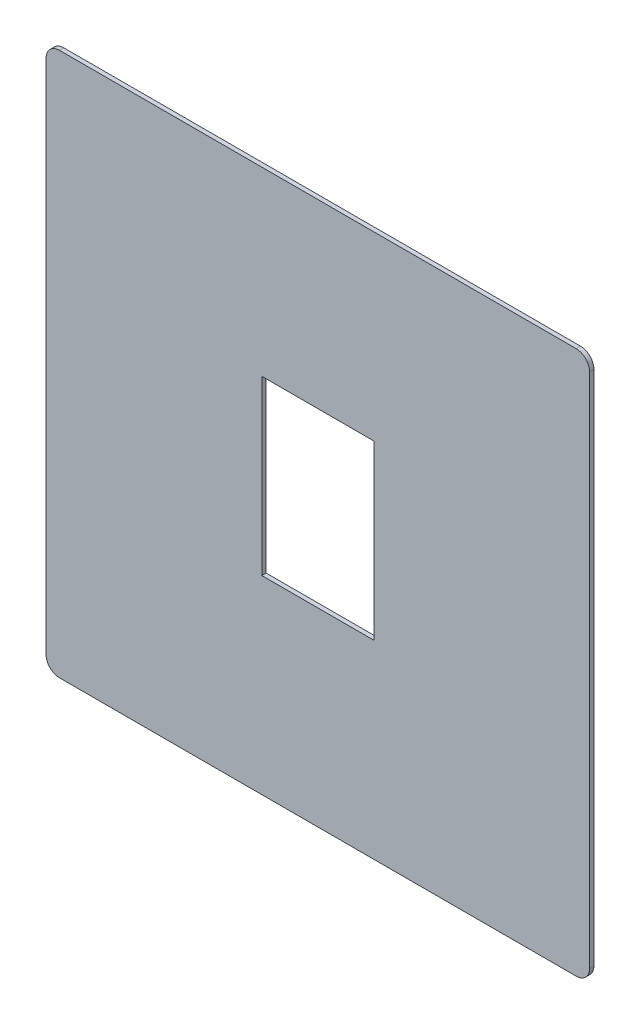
ISO-10303-21;
HEADER;
FILE_DESCRIPTION(('STEP AP214'),'2;1');
FILE_NAME('part.step','',(''),(''),'','','');
FILE_SCHEMA(('AUTOMOTIVE_DESIGN { 1 0 10303 214 1 1 1 1 }'));
ENDSEC;
DATA;
#1=APPLICATION_CONTEXT('core data for automotive mechanical design processes');
#2=APPLICATION_PROTOCOL_DEFINITION('international standard','automotive_design',2000,#1);
#3=PRODUCT_CONTEXT('',#1,'mechanical');
#4=PRODUCT('Part','Part','',(#3));
#5=PRODUCT_RELATED_PRODUCT_CATEGORY('part','',(#4));
#6=PRODUCT_DEFINITION_FORMATION('','',#4);
#7=PRODUCT_DEFINITION_CONTEXT('part definition',#1,'design');
#8=PRODUCT_DEFINITION('design','',#6,#7);
#9=PRODUCT_DEFINITION_SHAPE('','',#8);
#10=(LENGTH_UNIT() NAMED_UNIT(*) SI_UNIT(.MILLI.,.METRE.));
#11=(NAMED_UNIT(*) PLANE_ANGLE_UNIT() SI_UNIT($,.RADIAN.));
#12=(NAMED_UNIT(*) SI_UNIT($,.STERADIAN.) SOLID_ANGLE_UNIT());
#13=UNCERTAINTY_MEASURE_WITH_UNIT(LENGTH_MEASURE(1.E-05),#10,'distance_accuracy_value','');
#14=(GEOMETRIC_REPRESENTATION_CONTEXT(3) GLOBAL_UNCERTAINTY_ASSIGNED_CONTEXT((#13)) GLOBAL_UNIT_ASSIGNED_CONTEXT((#10,
#11,#12)) REPRESENTATION_CONTEXT('',''));
#15=CARTESIAN_POINT('',(0.,0.,0.));
#16=DIRECTION('',(0.,0.,1.));
#17=DIRECTION('',(1.,0.,0.));
#18=AXIS2_PLACEMENT_3D('',#15,#16,#17);
#19=CARTESIAN_POINT('',(29.9497474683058,29.4497474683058,0.5));
#20=DIRECTION('',(0.,0.,1.));
#21=DIRECTION('',(1.,0.,0.));
#22=AXIS2_PLACEMENT_3D('',#19,#20,#21);
#23=PLANE('',#22);
#24=CARTESIAN_POINT('',(29.9497474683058,29.4497474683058,0.5));
#25=DIRECTION('',(0.,0.,1.));
#26=DIRECTION('',(1.,0.,0.));
#27=AXIS2_PLACEMENT_3D('',#24,#25,#26);
#28=CIRCLE('',#27,1.55025253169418);
#29=CARTESIAN_POINT('',(31.5,29.4497474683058,0.5));
#30=VERTEX_POINT('',#29);
#31=CARTESIAN_POINT('',(29.9497474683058,31.,0.5));
#32=VERTEX_POINT('',#31);
#33=EDGE_CURVE('E172',#30,#32,#28,.T.);
#34=ORIENTED_EDGE('',*,*,#33,.T.);
#35=DIRECTION('',(-1.,0.,0.));
#36=VECTOR('',#35,1.);
#37=CARTESIAN_POINT('',(29.9497474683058,31.,0.5));
#38=LINE('',#37,#36);
#39=CARTESIAN_POINT('',(-29.9497474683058,31.,0.5));
#40=VERTEX_POINT('',#39);
#41=EDGE_CURVE('E175',#32,#40,#38,.T.);
#42=ORIENTED_EDGE('',*,*,#41,.T.);
#43=CARTESIAN_POINT('',(-29.9497474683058,29.4497474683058,0.5));
#44=DIRECTION('',(0.,0.,1.));
#45=DIRECTION('',(1.,0.,0.));
#46=AXIS2_PLACEMENT_3D('',#43,#44,#45);
#47=CIRCLE('',#46,1.55025253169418);
#48=CARTESIAN_POINT('',(-31.5,29.4497474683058,0.5));
#49=VERTEX_POINT('',#48);
#50=EDGE_CURVE('E177',#40,#49,#47,.T.);
#51=ORIENTED_EDGE('',*,*,#50,.T.);
#52=DIRECTION('',(0.,-1.,0.));
#53=VECTOR('',#52,1.);
#54=CARTESIAN_POINT('',(-31.5,29.4497474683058,0.5));
#55=LINE('',#54,#53);
#56=CARTESIAN_POINT('',(-31.5,-30.4497474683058,0.5));
#57=VERTEX_POINT('',#56);
#58=EDGE_CURVE('E179',#49,#57,#55,.T.);
#59=ORIENTED_EDGE('',*,*,#58,.T.);
#60=CARTESIAN_POINT('',(-29.9497474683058,-30.4497474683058,0.5));
#61=DIRECTION('',(0.,0.,1.));
#62=DIRECTION('',(1.,0.,0.));
#63=AXIS2_PLACEMENT_3D('',#60,#61,#62);
#64=CIRCLE('',#63,1.55025253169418);
#65=CARTESIAN_POINT('',(-29.9497474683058,-32.,0.5));
#66=VERTEX_POINT('',#65);
#67=EDGE_CURVE('E181',#57,#66,#64,.T.);
#68=ORIENTED_EDGE('',*,*,#67,.T.);
#69=DIRECTION('',(1.,0.,0.));
#70=VECTOR('',#69,1.);
#71=CARTESIAN_POINT('',(-29.9497474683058,-32.,0.5));
#72=LINE('',#71,#70);
#73=CARTESIAN_POINT('',(29.9497474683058,-32.,0.5));
#74=VERTEX_POINT('',#73);
#75=EDGE_CURVE('E183',#66,#74,#72,.T.);
#76=ORIENTED_EDGE('',*,*,#75,.T.);
#77=CARTESIAN_POINT('',(29.9497474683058,-30.4497474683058,0.5));
#78=DIRECTION('',(0.,0.,1.));
#79=DIRECTION('',(1.,0.,0.));
#80=AXIS2_PLACEMENT_3D('',#77,#78,#79);
#81=CIRCLE('',#80,1.55025253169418);
#82=CARTESIAN_POINT('',(31.5,-30.4497474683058,0.5));
#83=VERTEX_POINT('',#82);
#84=EDGE_CURVE('E185',#74,#83,#81,.T.);
#85=ORIENTED_EDGE('',*,*,#84,.T.);
#86=DIRECTION('',(0.,1.,0.));
#87=VECTOR('',#86,1.);
#88=CARTESIAN_POINT('',(31.5,-30.4497474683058,0.5));
#89=LINE('',#88,#87);
#90=EDGE_CURVE('E187',#83,#30,#89,.T.);
#91=ORIENTED_EDGE('',*,*,#90,.T.);
#92=EDGE_LOOP('',(#34,#42,#51,#59,#68,#76,#85,#91));
#93=FACE_BOUND('',#92,.T.);
#94=DIRECTION('',(0.,-1.,0.));
#95=VECTOR('',#94,1.);
#96=CARTESIAN_POINT('',(-6.5,10.,0.5));
#97=LINE('',#96,#95);
#98=CARTESIAN_POINT('',(-6.5,10.,0.5));
#99=VERTEX_POINT('',#98);
#100=CARTESIAN_POINT('',(-6.5,-9.99999999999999,0.5));
#101=VERTEX_POINT('',#100);
#102=EDGE_CURVE('E146',#99,#101,#97,.T.);
#103=ORIENTED_EDGE('',*,*,#102,.F.);
#104=DIRECTION('',(-1.,0.,0.));
#105=VECTOR('',#104,1.);
#106=CARTESIAN_POINT('',(6.5,10.,0.5));
#107=LINE('',#106,#105);
#108=CARTESIAN_POINT('',(6.5,10.,0.5));
#109=VERTEX_POINT('',#108);
#110=EDGE_CURVE('E135',#109,#99,#107,.T.);
#111=ORIENTED_EDGE('',*,*,#110,.F.);
#112=DIRECTION('',(0.,1.,0.));
#113=VECTOR('',#112,1.);
#114=CARTESIAN_POINT('',(6.5,-10.,0.5));
#115=LINE('',#114,#113);
#116=CARTESIAN_POINT('',(6.5,-9.99999999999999,0.5));
#117=VERTEX_POINT('',#116);
#118=EDGE_CURVE('E150',#117,#109,#115,.T.);
#119=ORIENTED_EDGE('',*,*,#118,.F.);
#120=DIRECTION('',(1.,0.,0.));
#121=VECTOR('',#120,1.);
#122=CARTESIAN_POINT('',(-6.5,-9.99999999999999,0.5));
#123=LINE('',#122,#121);
#124=EDGE_CURVE('E148',#101,#117,#123,.T.);
#125=ORIENTED_EDGE('',*,*,#124,.F.);
#126=EDGE_LOOP('',(#103,#111,#119,#125));
#127=FACE_BOUND('',#126,.T.);
#128=ADVANCED_FACE('F31',(#93,#127),#23,.T.);
#129=CARTESIAN_POINT('',(29.9497474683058,29.4497474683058,0.));
#130=DIRECTION('',(0.,0.,1.));
#131=DIRECTION('',(1.,0.,0.));
#132=AXIS2_PLACEMENT_3D('',#129,#130,#131);
#133=PLANE('',#132);
#134=CARTESIAN_POINT('',(29.9497474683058,29.4497474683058,0.));
#135=DIRECTION('',(0.,0.,1.));
#136=DIRECTION('',(1.,0.,0.));
#137=AXIS2_PLACEMENT_3D('',#134,#135,#136);
#138=CIRCLE('',#137,1.55025253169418);
#139=CARTESIAN_POINT('',(31.5,29.4497474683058,0.));
#140=VERTEX_POINT('',#139);
#141=CARTESIAN_POINT('',(29.9497474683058,31.,0.));
#142=VERTEX_POINT('',#141);
#143=EDGE_CURVE('E136',#140,#142,#138,.T.);
#144=ORIENTED_EDGE('',*,*,#143,.F.);
#145=DIRECTION('',(0.,1.,0.));
#146=VECTOR('',#145,1.);
#147=CARTESIAN_POINT('',(31.5,-30.4497474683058,0.));
#148=LINE('',#147,#146);
#149=CARTESIAN_POINT('',(31.5,-30.4497474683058,0.));
#150=VERTEX_POINT('',#149);
#151=EDGE_CURVE('E170',#150,#140,#148,.T.);
#152=ORIENTED_EDGE('',*,*,#151,.F.);
#153=CARTESIAN_POINT('',(29.9497474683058,-30.4497474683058,0.));
#154=DIRECTION('',(0.,0.,1.));
#155=DIRECTION('',(1.,0.,0.));
#156=AXIS2_PLACEMENT_3D('',#153,#154,#155);
#157=CIRCLE('',#156,1.55025253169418);
#158=CARTESIAN_POINT('',(29.9497474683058,-32.,0.));
#159=VERTEX_POINT('',#158);
#160=EDGE_CURVE('E168',#159,#150,#157,.T.);
#161=ORIENTED_EDGE('',*,*,#160,.F.);
#162=DIRECTION('',(1.,0.,0.));
#163=VECTOR('',#162,1.);
#164=CARTESIAN_POINT('',(-29.9497474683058,-32.,0.));
#165=LINE('',#164,#163);
#166=CARTESIAN_POINT('',(-29.9497474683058,-32.,0.));
#167=VERTEX_POINT('',#166);
#168=EDGE_CURVE('E166',#167,#159,#165,.T.);
#169=ORIENTED_EDGE('',*,*,#168,.F.);
#170=CARTESIAN_POINT('',(-29.9497474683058,-30.4497474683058,0.));
#171=DIRECTION('',(0.,0.,1.));
#172=DIRECTION('',(1.,0.,0.));
#173=AXIS2_PLACEMENT_3D('',#170,#171,#172);
#174=CIRCLE('',#173,1.55025253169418);
#175=CARTESIAN_POINT('',(-31.5,-30.4497474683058,0.));
#176=VERTEX_POINT('',#175);
#177=EDGE_CURVE('E164',#176,#167,#174,.T.);
#178=ORIENTED_EDGE('',*,*,#177,.F.);
#179=DIRECTION('',(0.,-1.,0.));
#180=VECTOR('',#179,1.);
#181=CARTESIAN_POINT('',(-31.5,29.4497474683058,0.));
#182=LINE('',#181,#180);
#183=CARTESIAN_POINT('',(-31.5,29.4497474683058,0.));
#184=VERTEX_POINT('',#183);
#185=EDGE_CURVE('E162',#184,#176,#182,.T.);
#186=ORIENTED_EDGE('',*,*,#185,.F.);
#187=CARTESIAN_POINT('',(-29.9497474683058,29.4497474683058,0.));
#188=DIRECTION('',(0.,0.,1.));
#189=DIRECTION('',(1.,0.,0.));
#190=AXIS2_PLACEMENT_3D('',#187,#188,#189);
#191=CIRCLE('',#190,1.55025253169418);
#192=CARTESIAN_POINT('',(-29.9497474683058,31.,0.));
#193=VERTEX_POINT('',#192);
#194=EDGE_CURVE('E160',#193,#184,#191,.T.);
#195=ORIENTED_EDGE('',*,*,#194,.F.);
#196=DIRECTION('',(-1.,0.,0.));
#197=VECTOR('',#196,1.);
#198=CARTESIAN_POINT('',(29.9497474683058,31.,0.));
#199=LINE('',#198,#197);
#200=EDGE_CURVE('E158',#142,#193,#199,.T.);
#201=ORIENTED_EDGE('',*,*,#200,.F.);
#202=EDGE_LOOP('',(#144,#152,#161,#169,#178,#186,#195,#201));
#203=FACE_BOUND('',#202,.T.);
#204=DIRECTION('',(-1.,0.,0.));
#205=VECTOR('',#204,1.);
#206=CARTESIAN_POINT('',(6.5,10.,0.));
#207=LINE('',#206,#205);
#208=CARTESIAN_POINT('',(6.5,10.,0.));
#209=VERTEX_POINT('',#208);
#210=CARTESIAN_POINT('',(-6.5,10.,0.));
#211=VERTEX_POINT('',#210);
#212=EDGE_CURVE('E54',#209,#211,#207,.T.);
#213=ORIENTED_EDGE('',*,*,#212,.T.);
#214=DIRECTION('',(0.,-1.,0.));
#215=VECTOR('',#214,1.);
#216=CARTESIAN_POINT('',(-6.5,10.,0.));
#217=LINE('',#216,#215);
#218=CARTESIAN_POINT('',(-6.5,-9.99999999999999,0.));
#219=VERTEX_POINT('',#218);
#220=EDGE_CURVE('E122',#211,#219,#217,.T.);
#221=ORIENTED_EDGE('',*,*,#220,.T.);
#222=DIRECTION('',(1.,0.,0.));
#223=VECTOR('',#222,1.);
#224=CARTESIAN_POINT('',(-6.5,-9.99999999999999,0.));
#225=LINE('',#224,#223);
#226=CARTESIAN_POINT('',(6.5,-10.,0.));
#227=VERTEX_POINT('',#226);
#228=EDGE_CURVE('E131',#219,#227,#225,.T.);
#229=ORIENTED_EDGE('',*,*,#228,.T.);
#230=DIRECTION('',(0.,1.,0.));
#231=VECTOR('',#230,1.);
#232=CARTESIAN_POINT('',(6.5,-10.,0.));
#233=LINE('',#232,#231);
#234=EDGE_CURVE('E140',#227,#209,#233,.T.);
#235=ORIENTED_EDGE('',*,*,#234,.T.);
#236=EDGE_LOOP('',(#213,#221,#229,#235));
#237=FACE_BOUND('',#236,.T.);
#238=ADVANCED_FACE('F139',(#203,#237),#133,.F.);
#239=CARTESIAN_POINT('',(29.9497474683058,29.4497474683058,0.5));
#240=DIRECTION('',(0.,0.,-1.));
#241=DIRECTION('',(-1.,0.,0.));
#242=AXIS2_PLACEMENT_3D('',#239,#240,#241);
#243=CYLINDRICAL_SURFACE('',#242,1.55025253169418);
#244=ORIENTED_EDGE('',*,*,#143,.T.);
#245=DIRECTION('',(0.,0.,-1.));
#246=VECTOR('',#245,1.);
#247=CARTESIAN_POINT('',(29.9497474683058,31.,0.5));
#248=LINE('',#247,#246);
#249=EDGE_CURVE('E11',#32,#142,#248,.T.);
#250=ORIENTED_EDGE('',*,*,#249,.F.);
#251=ORIENTED_EDGE('',*,*,#33,.F.);
#252=DIRECTION('',(0.,0.,-1.));
#253=VECTOR('',#252,1.);
#254=CARTESIAN_POINT('',(31.5,29.4497474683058,0.5));
#255=LINE('',#254,#253);
#256=EDGE_CURVE('E189',#30,#140,#255,.T.);
#257=ORIENTED_EDGE('',*,*,#256,.T.);
#258=EDGE_LOOP('',(#244,#250,#251,#257));
#259=FACE_BOUND('',#258,.T.);
#260=ADVANCED_FACE('F33',(#259),#243,.T.);
#261=CARTESIAN_POINT('',(29.9497474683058,31.,0.5));
#262=DIRECTION('',(0.,-1.,0.));
#263=DIRECTION('',(0.,0.,-1.));
#264=AXIS2_PLACEMENT_3D('',#261,#262,#263);
#265=PLANE('',#264);
#266=ORIENTED_EDGE('',*,*,#200,.T.);
#267=DIRECTION('',(0.,0.,-1.));
#268=VECTOR('',#267,1.);
#269=CARTESIAN_POINT('',(-29.9497474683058,31.,0.5));
#270=LINE('',#269,#268);
#271=EDGE_CURVE('E39',#40,#193,#270,.T.);
#272=ORIENTED_EDGE('',*,*,#271,.F.);
#273=ORIENTED_EDGE('',*,*,#41,.F.);
#274=ORIENTED_EDGE('',*,*,#249,.T.);
#275=EDGE_LOOP('',(#266,#272,#273,#274));
#276=FACE_BOUND('',#275,.T.);
#277=ADVANCED_FACE('F233',(#276),#265,.F.);
#278=CARTESIAN_POINT('',(-29.9497474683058,29.4497474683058,0.5));
#279=DIRECTION('',(0.,0.,-1.));
#280=DIRECTION('',(-1.,0.,0.));
#281=AXIS2_PLACEMENT_3D('',#278,#279,#280);
#282=CYLINDRICAL_SURFACE('',#281,1.55025253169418);
#283=ORIENTED_EDGE('',*,*,#194,.T.);
#284=DIRECTION('',(0.,0.,-1.));
#285=VECTOR('',#284,1.);
#286=CARTESIAN_POINT('',(-31.5,29.4497474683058,0.5));
#287=LINE('',#286,#285);
#288=EDGE_CURVE('E204',#49,#184,#287,.T.);
#289=ORIENTED_EDGE('',*,*,#288,.F.);
#290=ORIENTED_EDGE('',*,*,#50,.F.);
#291=ORIENTED_EDGE('',*,*,#271,.T.);
#292=EDGE_LOOP('',(#283,#289,#290,#291));
#293=FACE_BOUND('',#292,.T.);
#294=ADVANCED_FACE('F211',(#293),#282,.T.);
#295=CARTESIAN_POINT('',(-31.5,29.4497474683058,0.5));
#296=DIRECTION('',(1.,0.,0.));
#297=DIRECTION('',(0.,1.,0.));
#298=AXIS2_PLACEMENT_3D('',#295,#296,#297);
#299=PLANE('',#298);
#300=ORIENTED_EDGE('',*,*,#185,.T.);
#301=DIRECTION('',(0.,0.,-1.));
#302=VECTOR('',#301,1.);
#303=CARTESIAN_POINT('',(-31.5,-30.4497474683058,0.5));
#304=LINE('',#303,#302);
#305=EDGE_CURVE('E201',#57,#176,#304,.T.);
#306=ORIENTED_EDGE('',*,*,#305,.F.);
#307=ORIENTED_EDGE('',*,*,#58,.F.);
#308=ORIENTED_EDGE('',*,*,#288,.T.);
#309=EDGE_LOOP('',(#300,#306,#307,#308));
#310=FACE_BOUND('',#309,.T.);
#311=ADVANCED_FACE('F221',(#310),#299,.F.);
#312=CARTESIAN_POINT('',(-29.9497474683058,-30.4497474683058,0.5));
#313=DIRECTION('',(0.,0.,-1.));
#314=DIRECTION('',(-1.,0.,0.));
#315=AXIS2_PLACEMENT_3D('',#312,#313,#314);
#316=CYLINDRICAL_SURFACE('',#315,1.55025253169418);
#317=ORIENTED_EDGE('',*,*,#177,.T.);
#318=DIRECTION('',(0.,0.,-1.));
#319=VECTOR('',#318,1.);
#320=CARTESIAN_POINT('',(-29.9497474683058,-32.,0.5));
#321=LINE('',#320,#319);
#322=EDGE_CURVE('E198',#66,#167,#321,.T.);
#323=ORIENTED_EDGE('',*,*,#322,.F.);
#324=ORIENTED_EDGE('',*,*,#67,.F.);
#325=ORIENTED_EDGE('',*,*,#305,.T.);
#326=EDGE_LOOP('',(#317,#323,#324,#325));
#327=FACE_BOUND('',#326,.T.);
#328=ADVANCED_FACE('F225',(#327),#316,.T.);
#329=CARTESIAN_POINT('',(-29.9497474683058,-32.,0.5));
#330=DIRECTION('',(0.,1.,0.));
#331=DIRECTION('',(0.,0.,1.));
#332=AXIS2_PLACEMENT_3D('',#329,#330,#331);
#333=PLANE('',#332);
#334=ORIENTED_EDGE('',*,*,#168,.T.);
#335=DIRECTION('',(0.,0.,-1.));
#336=VECTOR('',#335,1.);
#337=CARTESIAN_POINT('',(29.9497474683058,-32.,0.5));
#338=LINE('',#337,#336);
#339=EDGE_CURVE('E195',#74,#159,#338,.T.);
#340=ORIENTED_EDGE('',*,*,#339,.F.);
#341=ORIENTED_EDGE('',*,*,#75,.F.);
#342=ORIENTED_EDGE('',*,*,#322,.T.);
#343=EDGE_LOOP('',(#334,#340,#341,#342));
#344=FACE_BOUND('',#343,.T.);
#345=ADVANCED_FACE('F246',(#344),#333,.F.);
#346=CARTESIAN_POINT('',(29.9497474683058,-30.4497474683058,0.5));
#347=DIRECTION('',(0.,0.,-1.));
#348=DIRECTION('',(-1.,0.,0.));
#349=AXIS2_PLACEMENT_3D('',#346,#347,#348);
#350=CYLINDRICAL_SURFACE('',#349,1.55025253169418);
#351=ORIENTED_EDGE('',*,*,#160,.T.);
#352=DIRECTION('',(0.,0.,-1.));
#353=VECTOR('',#352,1.);
#354=CARTESIAN_POINT('',(31.5,-30.4497474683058,0.5));
#355=LINE('',#354,#353);
#356=EDGE_CURVE('E192',#83,#150,#355,.T.);
#357=ORIENTED_EDGE('',*,*,#356,.F.);
#358=ORIENTED_EDGE('',*,*,#84,.F.);
#359=ORIENTED_EDGE('',*,*,#339,.T.);
#360=EDGE_LOOP('',(#351,#357,#358,#359));
#361=FACE_BOUND('',#360,.T.);
#362=ADVANCED_FACE('F244',(#361),#350,.T.);
#363=CARTESIAN_POINT('',(31.5,-30.4497474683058,0.5));
#364=DIRECTION('',(-1.,0.,0.));
#365=DIRECTION('',(0.,-1.,0.));
#366=AXIS2_PLACEMENT_3D('',#363,#364,#365);
#367=PLANE('',#366);
#368=ORIENTED_EDGE('',*,*,#151,.T.);
#369=ORIENTED_EDGE('',*,*,#256,.F.);
#370=ORIENTED_EDGE('',*,*,#90,.F.);
#371=ORIENTED_EDGE('',*,*,#356,.T.);
#372=EDGE_LOOP('',(#368,#369,#370,#371));
#373=FACE_BOUND('',#372,.T.);
#374=ADVANCED_FACE('F239',(#373),#367,.F.);
#375=CARTESIAN_POINT('',(6.5,10.,0.5));
#376=DIRECTION('',(0.,-1.,0.));
#377=DIRECTION('',(0.,0.,-1.));
#378=AXIS2_PLACEMENT_3D('',#375,#376,#377);
#379=PLANE('',#378);
#380=ORIENTED_EDGE('',*,*,#212,.F.);
#381=DIRECTION('',(0.,0.,-1.));
#382=VECTOR('',#381,1.);
#383=CARTESIAN_POINT('',(6.5,10.,0.5));
#384=LINE('',#383,#382);
#385=EDGE_CURVE('E152',#109,#209,#384,.T.);
#386=ORIENTED_EDGE('',*,*,#385,.F.);
#387=ORIENTED_EDGE('',*,*,#110,.T.);
#388=DIRECTION('',(0.,0.,-1.));
#389=VECTOR('',#388,1.);
#390=CARTESIAN_POINT('',(-6.5,10.,0.5));
#391=LINE('',#390,#389);
#392=EDGE_CURVE('E124',#99,#211,#391,.T.);
#393=ORIENTED_EDGE('',*,*,#392,.T.);
#394=EDGE_LOOP('',(#380,#386,#387,#393));
#395=FACE_BOUND('',#394,.T.);
#396=ADVANCED_FACE('F133',(#395),#379,.T.);
#397=CARTESIAN_POINT('',(-6.5,10.,0.5));
#398=DIRECTION('',(1.,0.,0.));
#399=DIRECTION('',(0.,1.,0.));
#400=AXIS2_PLACEMENT_3D('',#397,#398,#399);
#401=PLANE('',#400);
#402=ORIENTED_EDGE('',*,*,#220,.F.);
#403=ORIENTED_EDGE('',*,*,#392,.F.);
#404=ORIENTED_EDGE('',*,*,#102,.T.);
#405=DIRECTION('',(0.,0.,-1.));
#406=VECTOR('',#405,1.);
#407=CARTESIAN_POINT('',(-6.5,-9.99999999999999,0.5));
#408=LINE('',#407,#406);
#409=EDGE_CURVE('E127',#101,#219,#408,.T.);
#410=ORIENTED_EDGE('',*,*,#409,.T.);
#411=EDGE_LOOP('',(#402,#403,#404,#410));
#412=FACE_BOUND('',#411,.T.);
#413=ADVANCED_FACE('F123',(#412),#401,.T.);
#414=CARTESIAN_POINT('',(-6.5,-9.99999999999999,0.5));
#415=DIRECTION('',(0.,1.,0.));
#416=DIRECTION('',(-1.,0.,0.));
#417=AXIS2_PLACEMENT_3D('',#414,#415,#416);
#418=PLANE('',#417);
#419=ORIENTED_EDGE('',*,*,#228,.F.);
#420=ORIENTED_EDGE('',*,*,#409,.F.);
#421=ORIENTED_EDGE('',*,*,#124,.T.);
#422=DIRECTION('',(0.,0.,-1.));
#423=VECTOR('',#422,1.);
#424=CARTESIAN_POINT('',(6.5,-10.,0.5));
#425=LINE('',#424,#423);
#426=EDGE_CURVE('E46',#117,#227,#425,.T.);
#427=ORIENTED_EDGE('',*,*,#426,.T.);
#428=EDGE_LOOP('',(#419,#420,#421,#427));
#429=FACE_BOUND('',#428,.T.);
#430=ADVANCED_FACE('F270',(#429),#418,.T.);
#431=CARTESIAN_POINT('',(6.5,-10.,0.5));
#432=DIRECTION('',(-1.,0.,0.));
#433=DIRECTION('',(0.,-1.,0.));
#434=AXIS2_PLACEMENT_3D('',#431,#432,#433);
#435=PLANE('',#434);
#436=ORIENTED_EDGE('',*,*,#234,.F.);
#437=ORIENTED_EDGE('',*,*,#426,.F.);
#438=ORIENTED_EDGE('',*,*,#118,.T.);
#439=ORIENTED_EDGE('',*,*,#385,.T.);
#440=EDGE_LOOP('',(#436,#437,#438,#439));
#441=FACE_BOUND('',#440,.T.);
#442=ADVANCED_FACE('F275',(#441),#435,.T.);
#443=CLOSED_SHELL('',(#128,#238,#260,#277,#294,#311,#328,#345,#362,#374,#396,#413,#430,#442));
#444=MANIFOLD_SOLID_BREP('B2',#443);
#445=ADVANCED_BREP_SHAPE_REPRESENTATION('',(#18,#444),#14);
#446=SHAPE_DEFINITION_REPRESENTATION(#9,#445);
ENDSEC;
END-ISO-10303-21;
